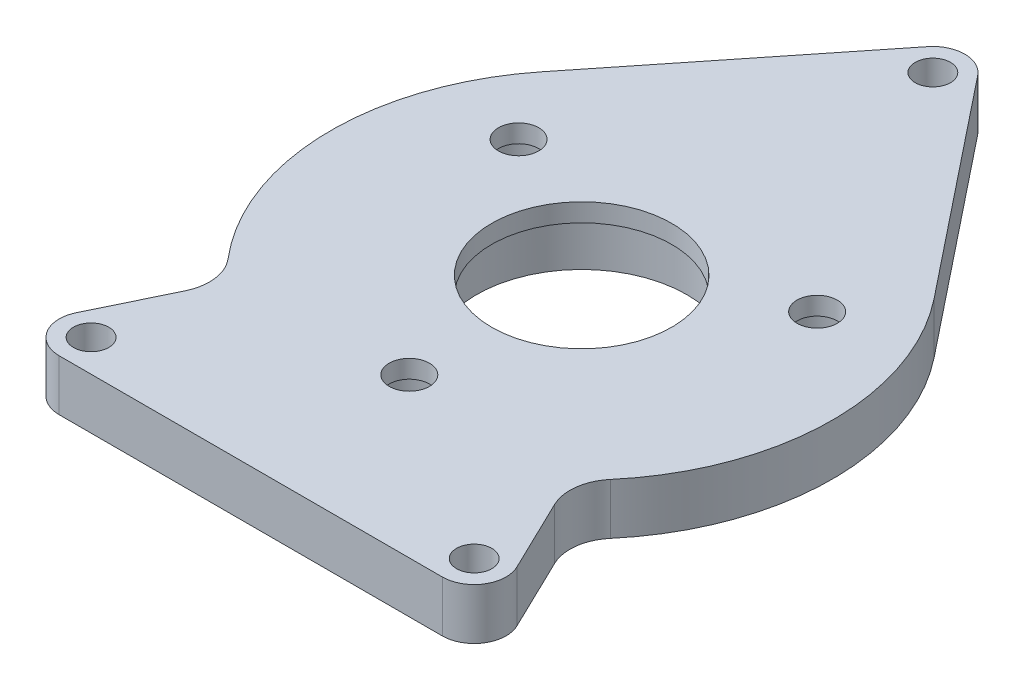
ISO-10303-21;
HEADER;
FILE_DESCRIPTION(('STEP AP214'),'2;1');
FILE_NAME('part.step','',(''),(''),'','','');
FILE_SCHEMA(('AUTOMOTIVE_DESIGN { 1 0 10303 214 1 1 1 1 }'));
ENDSEC;
DATA;
#1=APPLICATION_CONTEXT('core data for automotive mechanical design processes');
#2=APPLICATION_PROTOCOL_DEFINITION('international standard','automotive_design',2000,#1);
#3=PRODUCT_CONTEXT('',#1,'mechanical');
#4=PRODUCT('Part','Part','',(#3));
#5=PRODUCT_RELATED_PRODUCT_CATEGORY('part','',(#4));
#6=PRODUCT_DEFINITION_FORMATION('','',#4);
#7=PRODUCT_DEFINITION_CONTEXT('part definition',#1,'design');
#8=PRODUCT_DEFINITION('design','',#6,#7);
#9=PRODUCT_DEFINITION_SHAPE('','',#8);
#10=(LENGTH_UNIT() NAMED_UNIT(*) SI_UNIT(.MILLI.,.METRE.));
#11=(NAMED_UNIT(*) PLANE_ANGLE_UNIT() SI_UNIT($,.RADIAN.));
#12=(NAMED_UNIT(*) SI_UNIT($,.STERADIAN.) SOLID_ANGLE_UNIT());
#13=UNCERTAINTY_MEASURE_WITH_UNIT(LENGTH_MEASURE(1.E-05),#10,'distance_accuracy_value','');
#14=(GEOMETRIC_REPRESENTATION_CONTEXT(3) GLOBAL_UNCERTAINTY_ASSIGNED_CONTEXT((#13)) GLOBAL_UNIT_ASSIGNED_CONTEXT((#10,
#11,#12)) REPRESENTATION_CONTEXT('',''));
#15=CARTESIAN_POINT('',(0.,0.,0.));
#16=DIRECTION('',(0.,0.,1.));
#17=DIRECTION('',(1.,0.,0.));
#18=AXIS2_PLACEMENT_3D('',#15,#16,#17);
#19=CARTESIAN_POINT('',(26.67,7.112,41.6355512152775));
#20=DIRECTION('',(0.,1.,0.));
#21=DIRECTION('',(0.,0.,1.));
#22=AXIS2_PLACEMENT_3D('',#19,#20,#21);
#23=PLANE('',#22);
#24=CARTESIAN_POINT('',(26.6700000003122,7.112,41.6355512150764));
#25=DIRECTION('',(0.,1.,0.));
#26=DIRECTION('',(0.,0.,1.));
#27=AXIS2_PLACEMENT_3D('',#24,#25,#26);
#28=CIRCLE('',#27,2.45744999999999);
#29=CARTESIAN_POINT('',(26.6700000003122,7.112,44.0930012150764));
#30=VERTEX_POINT('',#29);
#31=EDGE_CURVE('E267',#30,#30,#28,.T.);
#32=ORIENTED_EDGE('',*,*,#31,.F.);
#33=EDGE_LOOP('',(#32));
#34=FACE_BOUND('',#33,.T.);
#35=CARTESIAN_POINT('',(-26.6699999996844,7.112,41.6355512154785));
#36=DIRECTION('',(0.,1.,0.));
#37=DIRECTION('',(0.,0.,1.));
#38=AXIS2_PLACEMENT_3D('',#35,#36,#37);
#39=CIRCLE('',#38,2.45744999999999);
#40=CARTESIAN_POINT('',(-26.6699999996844,7.112,44.0930012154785));
#41=VERTEX_POINT('',#40);
#42=EDGE_CURVE('E264',#41,#41,#39,.T.);
#43=ORIENTED_EDGE('',*,*,#42,.F.);
#44=EDGE_LOOP('',(#43));
#45=FACE_BOUND('',#44,.T.);
#46=CARTESIAN_POINT('',(-3.68547964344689E-10,7.112,-48.895));
#47=DIRECTION('',(0.,1.,0.));
#48=DIRECTION('',(0.,0.,1.));
#49=AXIS2_PLACEMENT_3D('',#46,#47,#48);
#50=CIRCLE('',#49,2.45744999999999);
#51=CARTESIAN_POINT('',(-3.68547964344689E-10,7.112,-46.43755));
#52=VERTEX_POINT('',#51);
#53=EDGE_CURVE('E261',#52,#52,#50,.T.);
#54=ORIENTED_EDGE('',*,*,#53,.F.);
#55=EDGE_LOOP('',(#54));
#56=FACE_BOUND('',#55,.T.);
#57=CARTESIAN_POINT('',(20.7846096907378,7.112,-12.0000000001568));
#58=DIRECTION('',(0.,-1.,0.));
#59=DIRECTION('',(0.,0.,-1.));
#60=AXIS2_PLACEMENT_3D('',#57,#58,#59);
#61=CIRCLE('',#60,2.8067);
#62=CARTESIAN_POINT('',(20.7846096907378,7.112,-14.8067000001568));
#63=VERTEX_POINT('',#62);
#64=EDGE_CURVE('E255',#63,#63,#61,.T.);
#65=ORIENTED_EDGE('',*,*,#64,.T.);
#66=EDGE_LOOP('',(#65));
#67=FACE_BOUND('',#66,.T.);
#68=CARTESIAN_POINT('',(1.82670343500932E-10,7.112,24.));
#69=DIRECTION('',(0.,-1.,0.));
#70=DIRECTION('',(0.,0.,-1.));
#71=AXIS2_PLACEMENT_3D('',#68,#69,#70);
#72=CIRCLE('',#71,2.8067);
#73=CARTESIAN_POINT('',(1.82670343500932E-10,7.112,21.1933));
#74=VERTEX_POINT('',#73);
#75=EDGE_CURVE('E249',#74,#74,#72,.T.);
#76=ORIENTED_EDGE('',*,*,#75,.T.);
#77=EDGE_LOOP('',(#76));
#78=FACE_BOUND('',#77,.T.);
#79=CARTESIAN_POINT('',(0.,7.112,0.));
#80=DIRECTION('',(0.,1.,0.));
#81=DIRECTION('',(0.,0.,1.));
#82=AXIS2_PLACEMENT_3D('',#79,#80,#81);
#83=CIRCLE('',#82,12.538100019);
#84=CARTESIAN_POINT('',(0.,7.112,12.538100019));
#85=VERTEX_POINT('',#84);
#86=EDGE_CURVE('E181',#85,#85,#83,.T.);
#87=ORIENTED_EDGE('',*,*,#86,.F.);
#88=EDGE_LOOP('',(#87));
#89=FACE_BOUND('',#88,.T.);
#90=CARTESIAN_POINT('',(26.67,7.112,41.6355512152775));
#91=DIRECTION('',(0.,1.,0.));
#92=DIRECTION('',(0.,0.,1.));
#93=AXIS2_PLACEMENT_3D('',#90,#91,#92);
#94=CIRCLE('',#93,4.445);
#95=CARTESIAN_POINT('',(26.67,7.112,46.0805512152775));
#96=VERTEX_POINT('',#95);
#97=CARTESIAN_POINT('',(30.6720324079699,7.112,39.7011878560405));
#98=VERTEX_POINT('',#97);
#99=EDGE_CURVE('E207',#96,#98,#94,.T.);
#100=ORIENTED_EDGE('',*,*,#99,.T.);
#101=DIRECTION('',(-0.435177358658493,0.,-0.900344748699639));
#102=VECTOR('',#101,1.);
#103=CARTESIAN_POINT('',(30.6720324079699,7.112,39.7011878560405));
#104=LINE('',#103,#102);
#105=CARTESIAN_POINT('',(25.7363789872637,7.112,29.4897429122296));
#106=VERTEX_POINT('',#105);
#107=EDGE_CURVE('E124',#98,#106,#104,.T.);
#108=ORIENTED_EDGE('',*,*,#107,.T.);
#109=CARTESIAN_POINT('',(31.4535681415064,7.112,26.7263666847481));
#110=DIRECTION('',(0.,-1.,0.));
#111=DIRECTION('',(0.,0.,-1.));
#112=AXIS2_PLACEMENT_3D('',#109,#110,#111);
#113=CIRCLE('',#112,6.35);
#114=CARTESIAN_POINT('',(26.6145576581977,7.112,22.6146179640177));
#115=VERTEX_POINT('',#114);
#116=EDGE_CURVE('E323',#106,#115,#113,.T.);
#117=ORIENTED_EDGE('',*,*,#116,.T.);
#118=CARTESIAN_POINT('',(0.,7.112,0.));
#119=DIRECTION('',(0.,1.,0.));
#120=DIRECTION('',(0.,0.,1.));
#121=AXIS2_PLACEMENT_3D('',#118,#119,#120);
#122=CIRCLE('',#121,34.925);
#123=CARTESIAN_POINT('',(27.308616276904,7.112,-21.7714285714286));
#124=VERTEX_POINT('',#123);
#125=EDGE_CURVE('E325',#115,#124,#122,.T.);
#126=ORIENTED_EDGE('',*,*,#125,.T.);
#127=DIRECTION('',(-0.623376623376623,0.,-0.781921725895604));
#128=VECTOR('',#127,1.);
#129=CARTESIAN_POINT('',(3.47564207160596,7.112,-51.6659090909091));
#130=LINE('',#129,#128);
#131=CARTESIAN_POINT('',(3.47564207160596,7.112,-51.6659090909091));
#132=VERTEX_POINT('',#131);
#133=EDGE_CURVE('E328',#124,#132,#130,.T.);
#134=ORIENTED_EDGE('',*,*,#133,.T.);
#135=CARTESIAN_POINT('',(0.,7.112,-48.895));
#136=DIRECTION('',(0.,1.,0.));
#137=DIRECTION('',(0.,0.,1.));
#138=AXIS2_PLACEMENT_3D('',#135,#136,#137);
#139=CIRCLE('',#138,4.445);
#140=CARTESIAN_POINT('',(-3.47564207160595,7.112,-51.6659090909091));
#141=VERTEX_POINT('',#140);
#142=EDGE_CURVE('E331',#132,#141,#139,.T.);
#143=ORIENTED_EDGE('',*,*,#142,.T.);
#144=DIRECTION('',(-0.623376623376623,0.,0.781921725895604));
#145=VECTOR('',#144,1.);
#146=CARTESIAN_POINT('',(-3.47564207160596,7.112,-51.6659090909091));
#147=LINE('',#146,#145);
#148=CARTESIAN_POINT('',(-27.3086162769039,7.112,-21.7714285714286));
#149=VERTEX_POINT('',#148);
#150=EDGE_CURVE('E334',#141,#149,#147,.T.);
#151=ORIENTED_EDGE('',*,*,#150,.T.);
#152=CARTESIAN_POINT('',(0.,7.112,0.));
#153=DIRECTION('',(0.,1.,0.));
#154=DIRECTION('',(0.,0.,1.));
#155=AXIS2_PLACEMENT_3D('',#152,#153,#154);
#156=CIRCLE('',#155,34.925);
#157=CARTESIAN_POINT('',(-26.6145576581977,7.112,22.6146179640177));
#158=VERTEX_POINT('',#157);
#159=EDGE_CURVE('E337',#149,#158,#156,.T.);
#160=ORIENTED_EDGE('',*,*,#159,.T.);
#161=CARTESIAN_POINT('',(-31.4535681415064,7.112,26.7263666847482));
#162=DIRECTION('',(0.,-1.,0.));
#163=DIRECTION('',(0.,0.,1.));
#164=AXIS2_PLACEMENT_3D('',#161,#162,#163);
#165=CIRCLE('',#164,6.35);
#166=CARTESIAN_POINT('',(-25.7363789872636,7.112,29.4897429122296));
#167=VERTEX_POINT('',#166);
#168=EDGE_CURVE('E159',#158,#167,#165,.T.);
#169=ORIENTED_EDGE('',*,*,#168,.T.);
#170=DIRECTION('',(-0.435177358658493,0.,0.90034474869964));
#171=VECTOR('',#170,1.);
#172=CARTESIAN_POINT('',(-25.7363789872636,7.112,29.4897429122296));
#173=LINE('',#172,#171);
#174=CARTESIAN_POINT('',(-30.6720324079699,7.112,39.7011878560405));
#175=VERTEX_POINT('',#174);
#176=EDGE_CURVE('E153',#167,#175,#173,.T.);
#177=ORIENTED_EDGE('',*,*,#176,.T.);
#178=CARTESIAN_POINT('',(-26.67,7.112,41.6355512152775));
#179=DIRECTION('',(0.,1.,0.));
#180=DIRECTION('',(0.,0.,1.));
#181=AXIS2_PLACEMENT_3D('',#178,#179,#180);
#182=CIRCLE('',#181,4.445);
#183=CARTESIAN_POINT('',(-26.67,7.112,46.0805512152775));
#184=VERTEX_POINT('',#183);
#185=EDGE_CURVE('E157',#175,#184,#182,.T.);
#186=ORIENTED_EDGE('',*,*,#185,.T.);
#187=DIRECTION('',(1.,0.,0.));
#188=VECTOR('',#187,1.);
#189=CARTESIAN_POINT('',(-26.67,7.112,46.0805512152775));
#190=LINE('',#189,#188);
#191=EDGE_CURVE('E63',#184,#96,#190,.T.);
#192=ORIENTED_EDGE('',*,*,#191,.T.);
#193=EDGE_LOOP('',(#100,#108,#117,#126,#134,#143,#151,#160,#169,#177,#186,#192));
#194=FACE_BOUND('',#193,.T.);
#195=CARTESIAN_POINT('',(-20.7846096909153,7.112,-11.9999999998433));
#196=DIRECTION('',(0.,-1.,0.));
#197=DIRECTION('',(0.,0.,-1.));
#198=AXIS2_PLACEMENT_3D('',#195,#196,#197);
#199=CIRCLE('',#198,2.8067);
#200=CARTESIAN_POINT('',(-20.7846096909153,7.112,-14.8066999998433));
#201=VERTEX_POINT('',#200);
#202=EDGE_CURVE('E243',#201,#201,#199,.T.);
#203=ORIENTED_EDGE('',*,*,#202,.T.);
#204=EDGE_LOOP('',(#203));
#205=FACE_BOUND('',#204,.T.);
#206=ADVANCED_FACE('F43',(#34,#45,#56,#67,#78,#89,#194,#205),#23,.T.);
#207=CARTESIAN_POINT('',(26.67,0.,41.6355512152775));
#208=DIRECTION('',(0.,1.,0.));
#209=DIRECTION('',(0.,0.,1.));
#210=AXIS2_PLACEMENT_3D('',#207,#208,#209);
#211=PLANE('',#210);
#212=CARTESIAN_POINT('',(26.6700000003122,0.,41.6355512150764));
#213=DIRECTION('',(0.,1.,0.));
#214=DIRECTION('',(0.,0.,1.));
#215=AXIS2_PLACEMENT_3D('',#212,#213,#214);
#216=CIRCLE('',#215,2.45744999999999);
#217=CARTESIAN_POINT('',(26.6700000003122,0.,44.0930012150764));
#218=VERTEX_POINT('',#217);
#219=EDGE_CURVE('E265',#218,#218,#216,.T.);
#220=ORIENTED_EDGE('',*,*,#219,.T.);
#221=EDGE_LOOP('',(#220));
#222=FACE_BOUND('',#221,.T.);
#223=CARTESIAN_POINT('',(-26.6699999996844,0.,41.6355512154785));
#224=DIRECTION('',(0.,1.,0.));
#225=DIRECTION('',(0.,0.,1.));
#226=AXIS2_PLACEMENT_3D('',#223,#224,#225);
#227=CIRCLE('',#226,2.45744999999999);
#228=CARTESIAN_POINT('',(-26.6699999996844,0.,44.0930012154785));
#229=VERTEX_POINT('',#228);
#230=EDGE_CURVE('E262',#229,#229,#227,.T.);
#231=ORIENTED_EDGE('',*,*,#230,.T.);
#232=EDGE_LOOP('',(#231));
#233=FACE_BOUND('',#232,.T.);
#234=CARTESIAN_POINT('',(-3.68547964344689E-10,0.,-48.895));
#235=DIRECTION('',(0.,1.,0.));
#236=DIRECTION('',(0.,0.,1.));
#237=AXIS2_PLACEMENT_3D('',#234,#235,#236);
#238=CIRCLE('',#237,2.45744999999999);
#239=CARTESIAN_POINT('',(-3.68547964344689E-10,0.,-46.43755));
#240=VERTEX_POINT('',#239);
#241=EDGE_CURVE('E256',#240,#240,#238,.T.);
#242=ORIENTED_EDGE('',*,*,#241,.T.);
#243=EDGE_LOOP('',(#242));
#244=FACE_BOUND('',#243,.T.);
#245=CARTESIAN_POINT('',(20.7846096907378,0.,-12.0000000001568));
#246=DIRECTION('',(0.,1.,0.));
#247=DIRECTION('',(0.,0.,1.));
#248=AXIS2_PLACEMENT_3D('',#245,#246,#247);
#249=CIRCLE('',#248,4.96062);
#250=CARTESIAN_POINT('',(20.7846096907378,0.,-7.03938000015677));
#251=VERTEX_POINT('',#250);
#252=EDGE_CURVE('E250',#251,#251,#249,.T.);
#253=ORIENTED_EDGE('',*,*,#252,.T.);
#254=EDGE_LOOP('',(#253));
#255=FACE_BOUND('',#254,.T.);
#256=CARTESIAN_POINT('',(1.82670343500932E-10,0.,24.));
#257=DIRECTION('',(0.,1.,0.));
#258=DIRECTION('',(0.,0.,1.));
#259=AXIS2_PLACEMENT_3D('',#256,#257,#258);
#260=CIRCLE('',#259,4.96062);
#261=CARTESIAN_POINT('',(1.82670343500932E-10,0.,28.96062));
#262=VERTEX_POINT('',#261);
#263=EDGE_CURVE('E244',#262,#262,#260,.T.);
#264=ORIENTED_EDGE('',*,*,#263,.T.);
#265=EDGE_LOOP('',(#264));
#266=FACE_BOUND('',#265,.T.);
#267=CARTESIAN_POINT('',(-20.7846096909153,0.,-11.9999999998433));
#268=DIRECTION('',(0.,1.,0.));
#269=DIRECTION('',(0.,0.,1.));
#270=AXIS2_PLACEMENT_3D('',#267,#268,#269);
#271=CIRCLE('',#270,4.96062);
#272=CARTESIAN_POINT('',(-20.7846096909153,0.,-7.03937999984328));
#273=VERTEX_POINT('',#272);
#274=EDGE_CURVE('E238',#273,#273,#271,.T.);
#275=ORIENTED_EDGE('',*,*,#274,.T.);
#276=EDGE_LOOP('',(#275));
#277=FACE_BOUND('',#276,.T.);
#278=CARTESIAN_POINT('',(26.67,0.,41.6355512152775));
#279=DIRECTION('',(0.,1.,0.));
#280=DIRECTION('',(0.,0.,1.));
#281=AXIS2_PLACEMENT_3D('',#278,#279,#280);
#282=CIRCLE('',#281,4.445);
#283=CARTESIAN_POINT('',(26.67,0.,46.0805512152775));
#284=VERTEX_POINT('',#283);
#285=CARTESIAN_POINT('',(30.6720324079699,0.,39.7011878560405));
#286=VERTEX_POINT('',#285);
#287=EDGE_CURVE('E177',#284,#286,#282,.T.);
#288=ORIENTED_EDGE('',*,*,#287,.F.);
#289=DIRECTION('',(1.,0.,0.));
#290=VECTOR('',#289,1.);
#291=CARTESIAN_POINT('',(-26.67,0.,46.0805512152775));
#292=LINE('',#291,#290);
#293=CARTESIAN_POINT('',(-26.67,0.,46.0805512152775));
#294=VERTEX_POINT('',#293);
#295=EDGE_CURVE('E115',#294,#284,#292,.T.);
#296=ORIENTED_EDGE('',*,*,#295,.F.);
#297=CARTESIAN_POINT('',(-26.67,0.,41.6355512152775));
#298=DIRECTION('',(0.,1.,0.));
#299=DIRECTION('',(0.,0.,1.));
#300=AXIS2_PLACEMENT_3D('',#297,#298,#299);
#301=CIRCLE('',#300,4.445);
#302=CARTESIAN_POINT('',(-30.6720324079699,0.,39.7011878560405));
#303=VERTEX_POINT('',#302);
#304=EDGE_CURVE('E109',#303,#294,#301,.T.);
#305=ORIENTED_EDGE('',*,*,#304,.F.);
#306=DIRECTION('',(-0.435177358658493,0.,0.90034474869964));
#307=VECTOR('',#306,1.);
#308=CARTESIAN_POINT('',(-25.7363789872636,0.,29.4897429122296));
#309=LINE('',#308,#307);
#310=CARTESIAN_POINT('',(-25.7363789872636,0.,29.4897429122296));
#311=VERTEX_POINT('',#310);
#312=EDGE_CURVE('E167',#311,#303,#309,.T.);
#313=ORIENTED_EDGE('',*,*,#312,.F.);
#314=CARTESIAN_POINT('',(-31.4535681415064,0.,26.7263666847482));
#315=DIRECTION('',(0.,-1.,0.));
#316=DIRECTION('',(0.,0.,1.));
#317=AXIS2_PLACEMENT_3D('',#314,#315,#316);
#318=CIRCLE('',#317,6.35);
#319=CARTESIAN_POINT('',(-26.6145576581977,0.,22.6146179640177));
#320=VERTEX_POINT('',#319);
#321=EDGE_CURVE('E200',#320,#311,#318,.T.);
#322=ORIENTED_EDGE('',*,*,#321,.F.);
#323=CARTESIAN_POINT('',(0.,0.,0.));
#324=DIRECTION('',(0.,1.,0.));
#325=DIRECTION('',(0.,0.,1.));
#326=AXIS2_PLACEMENT_3D('',#323,#324,#325);
#327=CIRCLE('',#326,34.925);
#328=CARTESIAN_POINT('',(-27.3086162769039,0.,-21.7714285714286));
#329=VERTEX_POINT('',#328);
#330=EDGE_CURVE('E197',#329,#320,#327,.T.);
#331=ORIENTED_EDGE('',*,*,#330,.F.);
#332=DIRECTION('',(-0.623376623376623,0.,0.781921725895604));
#333=VECTOR('',#332,1.);
#334=CARTESIAN_POINT('',(-3.47564207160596,0.,-51.6659090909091));
#335=LINE('',#334,#333);
#336=CARTESIAN_POINT('',(-3.47564207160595,0.,-51.6659090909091));
#337=VERTEX_POINT('',#336);
#338=EDGE_CURVE('E194',#337,#329,#335,.T.);
#339=ORIENTED_EDGE('',*,*,#338,.F.);
#340=CARTESIAN_POINT('',(0.,0.,-48.895));
#341=DIRECTION('',(0.,1.,0.));
#342=DIRECTION('',(0.,0.,1.));
#343=AXIS2_PLACEMENT_3D('',#340,#341,#342);
#344=CIRCLE('',#343,4.445);
#345=CARTESIAN_POINT('',(3.47564207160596,0.,-51.6659090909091));
#346=VERTEX_POINT('',#345);
#347=EDGE_CURVE('E191',#346,#337,#344,.T.);
#348=ORIENTED_EDGE('',*,*,#347,.F.);
#349=DIRECTION('',(-0.623376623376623,0.,-0.781921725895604));
#350=VECTOR('',#349,1.);
#351=CARTESIAN_POINT('',(3.47564207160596,0.,-51.6659090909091));
#352=LINE('',#351,#350);
#353=CARTESIAN_POINT('',(27.308616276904,0.,-21.7714285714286));
#354=VERTEX_POINT('',#353);
#355=EDGE_CURVE('E188',#354,#346,#352,.T.);
#356=ORIENTED_EDGE('',*,*,#355,.F.);
#357=CARTESIAN_POINT('',(0.,0.,0.));
#358=DIRECTION('',(0.,1.,0.));
#359=DIRECTION('',(0.,0.,1.));
#360=AXIS2_PLACEMENT_3D('',#357,#358,#359);
#361=CIRCLE('',#360,34.925);
#362=CARTESIAN_POINT('',(26.6145576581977,0.,22.6146179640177));
#363=VERTEX_POINT('',#362);
#364=EDGE_CURVE('E185',#363,#354,#361,.T.);
#365=ORIENTED_EDGE('',*,*,#364,.F.);
#366=CARTESIAN_POINT('',(31.4535681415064,0.,26.7263666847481));
#367=DIRECTION('',(0.,-1.,0.));
#368=DIRECTION('',(0.,0.,-1.));
#369=AXIS2_PLACEMENT_3D('',#366,#367,#368);
#370=CIRCLE('',#369,6.35);
#371=CARTESIAN_POINT('',(25.7363789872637,0.,29.4897429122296));
#372=VERTEX_POINT('',#371);
#373=EDGE_CURVE('E183',#372,#363,#370,.T.);
#374=ORIENTED_EDGE('',*,*,#373,.F.);
#375=DIRECTION('',(-0.435177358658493,0.,-0.900344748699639));
#376=VECTOR('',#375,1.);
#377=CARTESIAN_POINT('',(30.6720324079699,0.,39.7011878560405));
#378=LINE('',#377,#376);
#379=EDGE_CURVE('E180',#286,#372,#378,.T.);
#380=ORIENTED_EDGE('',*,*,#379,.F.);
#381=EDGE_LOOP('',(#288,#296,#305,#313,#322,#331,#339,#348,#356,#365,#374,#380));
#382=FACE_BOUND('',#381,.T.);
#383=CARTESIAN_POINT('',(0.,0.,0.));
#384=DIRECTION('',(0.,1.,0.));
#385=DIRECTION('',(0.,0.,1.));
#386=AXIS2_PLACEMENT_3D('',#383,#384,#385);
#387=CIRCLE('',#386,19.0373);
#388=CARTESIAN_POINT('',(0.,0.,19.0373));
#389=VERTEX_POINT('',#388);
#390=EDGE_CURVE('E12',#389,#389,#387,.F.);
#391=ORIENTED_EDGE('',*,*,#390,.F.);
#392=EDGE_LOOP('',(#391));
#393=FACE_BOUND('',#392,.T.);
#394=ADVANCED_FACE('F351',(#222,#233,#244,#255,#266,#277,#382,#393),#211,.F.);
#395=CARTESIAN_POINT('',(26.67,7.112,41.6355512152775));
#396=DIRECTION('',(0.,-1.,0.));
#397=DIRECTION('',(0.,0.,-1.));
#398=AXIS2_PLACEMENT_3D('',#395,#396,#397);
#399=CYLINDRICAL_SURFACE('',#398,4.445);
#400=ORIENTED_EDGE('',*,*,#287,.T.);
#401=DIRECTION('',(0.,-1.,0.));
#402=VECTOR('',#401,1.);
#403=CARTESIAN_POINT('',(30.6720324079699,7.112,39.7011878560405));
#404=LINE('',#403,#402);
#405=EDGE_CURVE('E54',#98,#286,#404,.T.);
#406=ORIENTED_EDGE('',*,*,#405,.F.);
#407=ORIENTED_EDGE('',*,*,#99,.F.);
#408=DIRECTION('',(0.,-1.,0.));
#409=VECTOR('',#408,1.);
#410=CARTESIAN_POINT('',(26.67,7.112,46.0805512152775));
#411=LINE('',#410,#409);
#412=EDGE_CURVE('E173',#96,#284,#411,.T.);
#413=ORIENTED_EDGE('',*,*,#412,.T.);
#414=EDGE_LOOP('',(#400,#406,#407,#413));
#415=FACE_BOUND('',#414,.T.);
#416=ADVANCED_FACE('F45',(#415),#399,.T.);
#417=CARTESIAN_POINT('',(30.6720324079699,7.112,39.7011878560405));
#418=DIRECTION('',(-0.900344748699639,0.,0.435177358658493));
#419=DIRECTION('',(0.435177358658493,0.,0.90034474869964));
#420=AXIS2_PLACEMENT_3D('',#417,#418,#419);
#421=PLANE('',#420);
#422=ORIENTED_EDGE('',*,*,#379,.T.);
#423=DIRECTION('',(0.,-1.,0.));
#424=VECTOR('',#423,1.);
#425=CARTESIAN_POINT('',(25.7363789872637,7.112,29.4897429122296));
#426=LINE('',#425,#424);
#427=EDGE_CURVE('E234',#106,#372,#426,.T.);
#428=ORIENTED_EDGE('',*,*,#427,.F.);
#429=ORIENTED_EDGE('',*,*,#107,.F.);
#430=ORIENTED_EDGE('',*,*,#405,.T.);
#431=EDGE_LOOP('',(#422,#428,#429,#430));
#432=FACE_BOUND('',#431,.T.);
#433=ADVANCED_FACE('F580',(#432),#421,.F.);
#434=CARTESIAN_POINT('',(31.4535681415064,7.112,26.7263666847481));
#435=DIRECTION('',(0.,-1.,0.));
#436=DIRECTION('',(0.,0.,-1.));
#437=AXIS2_PLACEMENT_3D('',#434,#435,#436);
#438=CYLINDRICAL_SURFACE('',#437,6.35);
#439=ORIENTED_EDGE('',*,*,#373,.T.);
#440=DIRECTION('',(0.,-1.,0.));
#441=VECTOR('',#440,1.);
#442=CARTESIAN_POINT('',(26.6145576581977,7.112,22.6146179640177));
#443=LINE('',#442,#441);
#444=EDGE_CURVE('E231',#115,#363,#443,.T.);
#445=ORIENTED_EDGE('',*,*,#444,.F.);
#446=ORIENTED_EDGE('',*,*,#116,.F.);
#447=ORIENTED_EDGE('',*,*,#427,.T.);
#448=EDGE_LOOP('',(#439,#445,#446,#447));
#449=FACE_BOUND('',#448,.T.);
#450=ADVANCED_FACE('F586',(#449),#438,.F.);
#451=CARTESIAN_POINT('',(0.,7.112,0.));
#452=DIRECTION('',(0.,-1.,0.));
#453=DIRECTION('',(0.,0.,-1.));
#454=AXIS2_PLACEMENT_3D('',#451,#452,#453);
#455=CYLINDRICAL_SURFACE('',#454,34.925);
#456=ORIENTED_EDGE('',*,*,#364,.T.);
#457=DIRECTION('',(0.,-1.,0.));
#458=VECTOR('',#457,1.);
#459=CARTESIAN_POINT('',(27.308616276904,7.112,-21.7714285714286));
#460=LINE('',#459,#458);
#461=EDGE_CURVE('E227',#124,#354,#460,.T.);
#462=ORIENTED_EDGE('',*,*,#461,.F.);
#463=ORIENTED_EDGE('',*,*,#125,.F.);
#464=ORIENTED_EDGE('',*,*,#444,.T.);
#465=EDGE_LOOP('',(#456,#462,#463,#464));
#466=FACE_BOUND('',#465,.T.);
#467=ADVANCED_FACE('F592',(#466),#455,.T.);
#468=CARTESIAN_POINT('',(3.47564207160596,7.112,-51.6659090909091));
#469=DIRECTION('',(-0.781921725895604,0.,0.623376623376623));
#470=DIRECTION('',(0.623376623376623,0.,0.781921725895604));
#471=AXIS2_PLACEMENT_3D('',#468,#469,#470);
#472=PLANE('',#471);
#473=ORIENTED_EDGE('',*,*,#355,.T.);
#474=DIRECTION('',(0.,-1.,0.));
#475=VECTOR('',#474,1.);
#476=CARTESIAN_POINT('',(3.47564207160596,7.112,-51.6659090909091));
#477=LINE('',#476,#475);
#478=EDGE_CURVE('E223',#132,#346,#477,.T.);
#479=ORIENTED_EDGE('',*,*,#478,.F.);
#480=ORIENTED_EDGE('',*,*,#133,.F.);
#481=ORIENTED_EDGE('',*,*,#461,.T.);
#482=EDGE_LOOP('',(#473,#479,#480,#481));
#483=FACE_BOUND('',#482,.T.);
#484=ADVANCED_FACE('F600',(#483),#472,.F.);
#485=CARTESIAN_POINT('',(0.,7.112,-48.895));
#486=DIRECTION('',(0.,-1.,0.));
#487=DIRECTION('',(0.,0.,-1.));
#488=AXIS2_PLACEMENT_3D('',#485,#486,#487);
#489=CYLINDRICAL_SURFACE('',#488,4.445);
#490=ORIENTED_EDGE('',*,*,#347,.T.);
#491=DIRECTION('',(0.,-1.,0.));
#492=VECTOR('',#491,1.);
#493=CARTESIAN_POINT('',(-3.47564207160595,7.112,-51.6659090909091));
#494=LINE('',#493,#492);
#495=EDGE_CURVE('E219',#141,#337,#494,.T.);
#496=ORIENTED_EDGE('',*,*,#495,.F.);
#497=ORIENTED_EDGE('',*,*,#142,.F.);
#498=ORIENTED_EDGE('',*,*,#478,.T.);
#499=EDGE_LOOP('',(#490,#496,#497,#498));
#500=FACE_BOUND('',#499,.T.);
#501=ADVANCED_FACE('F605',(#500),#489,.T.);
#502=CARTESIAN_POINT('',(-3.47564207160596,7.112,-51.6659090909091));
#503=DIRECTION('',(0.781921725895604,0.,0.623376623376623));
#504=DIRECTION('',(0.623376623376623,0.,-0.781921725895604));
#505=AXIS2_PLACEMENT_3D('',#502,#503,#504);
#506=PLANE('',#505);
#507=ORIENTED_EDGE('',*,*,#338,.T.);
#508=DIRECTION('',(0.,-1.,0.));
#509=VECTOR('',#508,1.);
#510=CARTESIAN_POINT('',(-27.3086162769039,7.112,-21.7714285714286));
#511=LINE('',#510,#509);
#512=EDGE_CURVE('E215',#149,#329,#511,.T.);
#513=ORIENTED_EDGE('',*,*,#512,.F.);
#514=ORIENTED_EDGE('',*,*,#150,.F.);
#515=ORIENTED_EDGE('',*,*,#495,.T.);
#516=EDGE_LOOP('',(#507,#513,#514,#515));
#517=FACE_BOUND('',#516,.T.);
#518=ADVANCED_FACE('F612',(#517),#506,.F.);
#519=CARTESIAN_POINT('',(0.,7.112,0.));
#520=DIRECTION('',(0.,-1.,0.));
#521=DIRECTION('',(0.,0.,-1.));
#522=AXIS2_PLACEMENT_3D('',#519,#520,#521);
#523=CYLINDRICAL_SURFACE('',#522,34.925);
#524=ORIENTED_EDGE('',*,*,#330,.T.);
#525=DIRECTION('',(0.,-1.,0.));
#526=VECTOR('',#525,1.);
#527=CARTESIAN_POINT('',(-26.6145576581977,7.112,22.6146179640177));
#528=LINE('',#527,#526);
#529=EDGE_CURVE('E212',#158,#320,#528,.T.);
#530=ORIENTED_EDGE('',*,*,#529,.F.);
#531=ORIENTED_EDGE('',*,*,#159,.F.);
#532=ORIENTED_EDGE('',*,*,#512,.T.);
#533=EDGE_LOOP('',(#524,#530,#531,#532));
#534=FACE_BOUND('',#533,.T.);
#535=ADVANCED_FACE('F344',(#534),#523,.T.);
#536=CARTESIAN_POINT('',(-31.4535681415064,7.112,26.7263666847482));
#537=DIRECTION('',(0.,-1.,0.));
#538=DIRECTION('',(0.,0.,-1.));
#539=AXIS2_PLACEMENT_3D('',#536,#537,#538);
#540=CYLINDRICAL_SURFACE('',#539,6.35);
#541=ORIENTED_EDGE('',*,*,#321,.T.);
#542=DIRECTION('',(0.,-1.,0.));
#543=VECTOR('',#542,1.);
#544=CARTESIAN_POINT('',(-25.7363789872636,7.112,29.4897429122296));
#545=LINE('',#544,#543);
#546=EDGE_CURVE('E168',#167,#311,#545,.T.);
#547=ORIENTED_EDGE('',*,*,#546,.F.);
#548=ORIENTED_EDGE('',*,*,#168,.F.);
#549=ORIENTED_EDGE('',*,*,#529,.T.);
#550=EDGE_LOOP('',(#541,#547,#548,#549));
#551=FACE_BOUND('',#550,.T.);
#552=ADVANCED_FACE('F348',(#551),#540,.F.);
#553=CARTESIAN_POINT('',(-25.7363789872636,7.112,29.4897429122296));
#554=DIRECTION('',(0.900344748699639,0.,0.435177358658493));
#555=DIRECTION('',(0.435177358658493,0.,-0.90034474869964));
#556=AXIS2_PLACEMENT_3D('',#553,#554,#555);
#557=PLANE('',#556);
#558=ORIENTED_EDGE('',*,*,#312,.T.);
#559=DIRECTION('',(0.,-1.,0.));
#560=VECTOR('',#559,1.);
#561=CARTESIAN_POINT('',(-30.6720324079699,7.112,39.7011878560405));
#562=LINE('',#561,#560);
#563=EDGE_CURVE('E164',#175,#303,#562,.T.);
#564=ORIENTED_EDGE('',*,*,#563,.F.);
#565=ORIENTED_EDGE('',*,*,#176,.F.);
#566=ORIENTED_EDGE('',*,*,#546,.T.);
#567=EDGE_LOOP('',(#558,#564,#565,#566));
#568=FACE_BOUND('',#567,.T.);
#569=ADVANCED_FACE('F165',(#568),#557,.F.);
#570=CARTESIAN_POINT('',(-26.67,7.112,41.6355512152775));
#571=DIRECTION('',(0.,-1.,0.));
#572=DIRECTION('',(0.,0.,-1.));
#573=AXIS2_PLACEMENT_3D('',#570,#571,#572);
#574=CYLINDRICAL_SURFACE('',#573,4.445);
#575=ORIENTED_EDGE('',*,*,#304,.T.);
#576=DIRECTION('',(0.,-1.,0.));
#577=VECTOR('',#576,1.);
#578=CARTESIAN_POINT('',(-26.67,7.112,46.0805512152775));
#579=LINE('',#578,#577);
#580=EDGE_CURVE('E169',#184,#294,#579,.T.);
#581=ORIENTED_EDGE('',*,*,#580,.F.);
#582=ORIENTED_EDGE('',*,*,#185,.F.);
#583=ORIENTED_EDGE('',*,*,#563,.T.);
#584=EDGE_LOOP('',(#575,#581,#582,#583));
#585=FACE_BOUND('',#584,.T.);
#586=ADVANCED_FACE('F171',(#585),#574,.T.);
#587=CARTESIAN_POINT('',(-26.67,7.112,46.0805512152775));
#588=DIRECTION('',(0.,0.,-1.));
#589=DIRECTION('',(-1.,0.,0.));
#590=AXIS2_PLACEMENT_3D('',#587,#588,#589);
#591=PLANE('',#590);
#592=ORIENTED_EDGE('',*,*,#295,.T.);
#593=ORIENTED_EDGE('',*,*,#412,.F.);
#594=ORIENTED_EDGE('',*,*,#191,.F.);
#595=ORIENTED_EDGE('',*,*,#580,.T.);
#596=EDGE_LOOP('',(#592,#593,#594,#595));
#597=FACE_BOUND('',#596,.T.);
#598=ADVANCED_FACE('F357',(#597),#591,.F.);
#599=CARTESIAN_POINT('',(0.,7.112,0.));
#600=DIRECTION('',(0.,-1.,0.));
#601=DIRECTION('',(0.,0.,-1.));
#602=AXIS2_PLACEMENT_3D('',#599,#600,#601);
#603=CYLINDRICAL_SURFACE('',#602,12.538100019);
#604=CARTESIAN_POINT('',(0.,4.572,0.));
#605=DIRECTION('',(0.,1.,0.));
#606=DIRECTION('',(0.,0.,1.));
#607=AXIS2_PLACEMENT_3D('',#604,#605,#606);
#608=CIRCLE('',#607,12.538100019);
#609=CARTESIAN_POINT('',(0.,4.572,12.538100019));
#610=VERTEX_POINT('',#609);
#611=EDGE_CURVE('E47',#610,#610,#608,.T.);
#612=ORIENTED_EDGE('',*,*,#611,.F.);
#613=EDGE_LOOP('',(#612));
#614=FACE_BOUND('',#613,.T.);
#615=ORIENTED_EDGE('',*,*,#86,.T.);
#616=EDGE_LOOP('',(#615));
#617=FACE_BOUND('',#616,.T.);
#618=ADVANCED_FACE('F359',(#614,#617),#603,.F.);
#619=CARTESIAN_POINT('',(0.,-2.54,0.));
#620=DIRECTION('',(0.,-1.,0.));
#621=DIRECTION('',(0.,0.,-1.));
#622=AXIS2_PLACEMENT_3D('',#619,#620,#621);
#623=PLANE('',#622);
#624=CARTESIAN_POINT('',(0.,-2.54,0.));
#625=DIRECTION('',(0.,-1.,0.));
#626=DIRECTION('',(0.,0.,-1.));
#627=AXIS2_PLACEMENT_3D('',#624,#625,#626);
#628=CIRCLE('',#627,14.6431);
#629=CARTESIAN_POINT('',(0.,-2.54,-14.6431));
#630=VERTEX_POINT('',#629);
#631=EDGE_CURVE('E444',#630,#630,#628,.T.);
#632=ORIENTED_EDGE('',*,*,#631,.F.);
#633=EDGE_LOOP('',(#632));
#634=FACE_BOUND('',#633,.T.);
#635=CARTESIAN_POINT('',(0.,-2.54,0.));
#636=DIRECTION('',(0.,-1.,0.));
#637=DIRECTION('',(0.,0.,-1.));
#638=AXIS2_PLACEMENT_3D('',#635,#636,#637);
#639=CIRCLE('',#638,19.0373);
#640=CARTESIAN_POINT('',(0.,-2.54,-19.0373));
#641=VERTEX_POINT('',#640);
#642=EDGE_CURVE('E242',#641,#641,#639,.T.);
#643=ORIENTED_EDGE('',*,*,#642,.T.);
#644=EDGE_LOOP('',(#643));
#645=FACE_BOUND('',#644,.T.);
#646=ADVANCED_FACE('F365',(#634,#645),#623,.T.);
#647=CARTESIAN_POINT('',(0.,-2.54,0.));
#648=DIRECTION('',(0.,1.,0.));
#649=DIRECTION('',(0.,0.,1.));
#650=AXIS2_PLACEMENT_3D('',#647,#648,#649);
#651=CYLINDRICAL_SURFACE('',#650,19.0373);
#652=ORIENTED_EDGE('',*,*,#642,.F.);
#653=EDGE_LOOP('',(#652));
#654=FACE_BOUND('',#653,.T.);
#655=ORIENTED_EDGE('',*,*,#390,.T.);
#656=EDGE_LOOP('',(#655));
#657=FACE_BOUND('',#656,.T.);
#658=ADVANCED_FACE('F378',(#654,#657),#651,.T.);
#659=CARTESIAN_POINT('',(-20.7846096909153,-2.54,-11.9999999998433));
#660=DIRECTION('',(0.,-1.,0.));
#661=DIRECTION('',(0.,0.,-1.));
#662=AXIS2_PLACEMENT_3D('',#659,#660,#661);
#663=CYLINDRICAL_SURFACE('',#662,4.96062);
#664=CARTESIAN_POINT('',(-20.7846096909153,4.5974,-11.9999999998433));
#665=DIRECTION('',(0.,-1.,0.));
#666=DIRECTION('',(0.,0.,-1.));
#667=AXIS2_PLACEMENT_3D('',#664,#665,#666);
#668=CIRCLE('',#667,4.96062);
#669=CARTESIAN_POINT('',(-20.7846096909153,4.5974,-16.9606199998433));
#670=VERTEX_POINT('',#669);
#671=EDGE_CURVE('E248',#670,#670,#668,.T.);
#672=ORIENTED_EDGE('',*,*,#671,.F.);
#673=EDGE_LOOP('',(#672));
#674=FACE_BOUND('',#673,.T.);
#675=ORIENTED_EDGE('',*,*,#274,.F.);
#676=EDGE_LOOP('',(#675));
#677=FACE_BOUND('',#676,.T.);
#678=ADVANCED_FACE('F381',(#674,#677),#663,.F.);
#679=CARTESIAN_POINT('',(-20.7846096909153,-2.54,-11.9999999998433));
#680=DIRECTION('',(0.,-1.,0.));
#681=DIRECTION('',(0.,0.,-1.));
#682=AXIS2_PLACEMENT_3D('',#679,#680,#681);
#683=CYLINDRICAL_SURFACE('',#682,2.8067);
#684=ORIENTED_EDGE('',*,*,#202,.F.);
#685=EDGE_LOOP('',(#684));
#686=FACE_BOUND('',#685,.T.);
#687=CARTESIAN_POINT('',(-20.7846096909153,4.5974,-11.9999999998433));
#688=DIRECTION('',(0.,-1.,0.));
#689=DIRECTION('',(0.,0.,-1.));
#690=AXIS2_PLACEMENT_3D('',#687,#688,#689);
#691=CIRCLE('',#690,2.8067);
#692=CARTESIAN_POINT('',(-20.7846096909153,4.5974,-14.8066999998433));
#693=VERTEX_POINT('',#692);
#694=EDGE_CURVE('E308',#693,#693,#691,.T.);
#695=ORIENTED_EDGE('',*,*,#694,.T.);
#696=EDGE_LOOP('',(#695));
#697=FACE_BOUND('',#696,.T.);
#698=ADVANCED_FACE('F386',(#686,#697),#683,.F.);
#699=CARTESIAN_POINT('',(-17.9779096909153,4.5974,-11.9999999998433));
#700=DIRECTION('',(0.,1.,0.));
#701=DIRECTION('',(0.,0.,1.));
#702=AXIS2_PLACEMENT_3D('',#699,#700,#701);
#703=PLANE('',#702);
#704=ORIENTED_EDGE('',*,*,#694,.F.);
#705=EDGE_LOOP('',(#704));
#706=FACE_BOUND('',#705,.T.);
#707=ORIENTED_EDGE('',*,*,#671,.T.);
#708=EDGE_LOOP('',(#707));
#709=FACE_BOUND('',#708,.T.);
#710=ADVANCED_FACE('F389',(#706,#709),#703,.F.);
#711=CARTESIAN_POINT('',(1.82670343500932E-10,-2.54,24.));
#712=DIRECTION('',(0.,-1.,0.));
#713=DIRECTION('',(0.,0.,-1.));
#714=AXIS2_PLACEMENT_3D('',#711,#712,#713);
#715=CYLINDRICAL_SURFACE('',#714,4.96062);
#716=CARTESIAN_POINT('',(1.82670343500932E-10,4.5974,24.));
#717=DIRECTION('',(0.,-1.,0.));
#718=DIRECTION('',(0.,0.,-1.));
#719=AXIS2_PLACEMENT_3D('',#716,#717,#718);
#720=CIRCLE('',#719,4.96062);
#721=CARTESIAN_POINT('',(1.82670343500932E-10,4.5974,19.03938));
#722=VERTEX_POINT('',#721);
#723=EDGE_CURVE('E254',#722,#722,#720,.T.);
#724=ORIENTED_EDGE('',*,*,#723,.F.);
#725=EDGE_LOOP('',(#724));
#726=FACE_BOUND('',#725,.T.);
#727=ORIENTED_EDGE('',*,*,#263,.F.);
#728=EDGE_LOOP('',(#727));
#729=FACE_BOUND('',#728,.T.);
#730=ADVANCED_FACE('F393',(#726,#729),#715,.F.);
#731=CARTESIAN_POINT('',(1.82670343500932E-10,-2.54,24.));
#732=DIRECTION('',(0.,-1.,0.));
#733=DIRECTION('',(0.,0.,-1.));
#734=AXIS2_PLACEMENT_3D('',#731,#732,#733);
#735=CYLINDRICAL_SURFACE('',#734,2.8067);
#736=ORIENTED_EDGE('',*,*,#75,.F.);
#737=EDGE_LOOP('',(#736));
#738=FACE_BOUND('',#737,.T.);
#739=CARTESIAN_POINT('',(1.82670343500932E-10,4.5974,24.));
#740=DIRECTION('',(0.,-1.,0.));
#741=DIRECTION('',(0.,0.,-1.));
#742=AXIS2_PLACEMENT_3D('',#739,#740,#741);
#743=CIRCLE('',#742,2.8067);
#744=CARTESIAN_POINT('',(1.82670343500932E-10,4.5974,21.1933));
#745=VERTEX_POINT('',#744);
#746=EDGE_CURVE('E298',#745,#745,#743,.T.);
#747=ORIENTED_EDGE('',*,*,#746,.T.);
#748=EDGE_LOOP('',(#747));
#749=FACE_BOUND('',#748,.T.);
#750=ADVANCED_FACE('F398',(#738,#749),#735,.F.);
#751=CARTESIAN_POINT('',(2.80670000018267,4.5974,24.));
#752=DIRECTION('',(0.,1.,0.));
#753=DIRECTION('',(0.,0.,1.));
#754=AXIS2_PLACEMENT_3D('',#751,#752,#753);
#755=PLANE('',#754);
#756=ORIENTED_EDGE('',*,*,#746,.F.);
#757=EDGE_LOOP('',(#756));
#758=FACE_BOUND('',#757,.T.);
#759=ORIENTED_EDGE('',*,*,#723,.T.);
#760=EDGE_LOOP('',(#759));
#761=FACE_BOUND('',#760,.T.);
#762=ADVANCED_FACE('F401',(#758,#761),#755,.F.);
#763=CARTESIAN_POINT('',(20.7846096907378,-2.54,-12.0000000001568));
#764=DIRECTION('',(0.,-1.,0.));
#765=DIRECTION('',(0.,0.,-1.));
#766=AXIS2_PLACEMENT_3D('',#763,#764,#765);
#767=CYLINDRICAL_SURFACE('',#766,4.96062);
#768=CARTESIAN_POINT('',(20.7846096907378,4.5974,-12.0000000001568));
#769=DIRECTION('',(0.,-1.,0.));
#770=DIRECTION('',(0.,0.,-1.));
#771=AXIS2_PLACEMENT_3D('',#768,#769,#770);
#772=CIRCLE('',#771,4.96062);
#773=CARTESIAN_POINT('',(20.7846096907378,4.5974,-16.9606200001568));
#774=VERTEX_POINT('',#773);
#775=EDGE_CURVE('E260',#774,#774,#772,.T.);
#776=ORIENTED_EDGE('',*,*,#775,.F.);
#777=EDGE_LOOP('',(#776));
#778=FACE_BOUND('',#777,.T.);
#779=ORIENTED_EDGE('',*,*,#252,.F.);
#780=EDGE_LOOP('',(#779));
#781=FACE_BOUND('',#780,.T.);
#782=ADVANCED_FACE('F405',(#778,#781),#767,.F.);
#783=CARTESIAN_POINT('',(20.7846096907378,-2.54,-12.0000000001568));
#784=DIRECTION('',(0.,-1.,0.));
#785=DIRECTION('',(0.,0.,-1.));
#786=AXIS2_PLACEMENT_3D('',#783,#784,#785);
#787=CYLINDRICAL_SURFACE('',#786,2.8067);
#788=ORIENTED_EDGE('',*,*,#64,.F.);
#789=EDGE_LOOP('',(#788));
#790=FACE_BOUND('',#789,.T.);
#791=CARTESIAN_POINT('',(20.7846096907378,4.5974,-12.0000000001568));
#792=DIRECTION('',(0.,-1.,0.));
#793=DIRECTION('',(0.,0.,-1.));
#794=AXIS2_PLACEMENT_3D('',#791,#792,#793);
#795=CIRCLE('',#794,2.8067);
#796=CARTESIAN_POINT('',(20.7846096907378,4.5974,-14.8067000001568));
#797=VERTEX_POINT('',#796);
#798=EDGE_CURVE('E288',#797,#797,#795,.T.);
#799=ORIENTED_EDGE('',*,*,#798,.T.);
#800=EDGE_LOOP('',(#799));
#801=FACE_BOUND('',#800,.T.);
#802=ADVANCED_FACE('F410',(#790,#801),#787,.F.);
#803=CARTESIAN_POINT('',(23.5913096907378,4.5974,-12.0000000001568));
#804=DIRECTION('',(0.,1.,0.));
#805=DIRECTION('',(0.,0.,1.));
#806=AXIS2_PLACEMENT_3D('',#803,#804,#805);
#807=PLANE('',#806);
#808=ORIENTED_EDGE('',*,*,#798,.F.);
#809=EDGE_LOOP('',(#808));
#810=FACE_BOUND('',#809,.T.);
#811=ORIENTED_EDGE('',*,*,#775,.T.);
#812=EDGE_LOOP('',(#811));
#813=FACE_BOUND('',#812,.T.);
#814=ADVANCED_FACE('F413',(#810,#813),#807,.F.);
#815=CARTESIAN_POINT('',(-3.68547964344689E-10,7.112,-48.895));
#816=DIRECTION('',(0.,1.,0.));
#817=DIRECTION('',(0.,0.,1.));
#818=AXIS2_PLACEMENT_3D('',#815,#816,#817);
#819=CYLINDRICAL_SURFACE('',#818,2.45744999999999);
#820=ORIENTED_EDGE('',*,*,#53,.T.);
#821=EDGE_LOOP('',(#820));
#822=FACE_BOUND('',#821,.T.);
#823=ORIENTED_EDGE('',*,*,#241,.F.);
#824=EDGE_LOOP('',(#823));
#825=FACE_BOUND('',#824,.T.);
#826=ADVANCED_FACE('F417',(#822,#825),#819,.F.);
#827=CARTESIAN_POINT('',(-26.6699999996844,7.112,41.6355512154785));
#828=DIRECTION('',(0.,1.,0.));
#829=DIRECTION('',(0.,0.,1.));
#830=AXIS2_PLACEMENT_3D('',#827,#828,#829);
#831=CYLINDRICAL_SURFACE('',#830,2.45744999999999);
#832=ORIENTED_EDGE('',*,*,#42,.T.);
#833=EDGE_LOOP('',(#832));
#834=FACE_BOUND('',#833,.T.);
#835=ORIENTED_EDGE('',*,*,#230,.F.);
#836=EDGE_LOOP('',(#835));
#837=FACE_BOUND('',#836,.T.);
#838=ADVANCED_FACE('F424',(#834,#837),#831,.F.);
#839=CARTESIAN_POINT('',(26.6700000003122,7.112,41.6355512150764));
#840=DIRECTION('',(0.,1.,0.));
#841=DIRECTION('',(0.,0.,1.));
#842=AXIS2_PLACEMENT_3D('',#839,#840,#841);
#843=CYLINDRICAL_SURFACE('',#842,2.45744999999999);
#844=ORIENTED_EDGE('',*,*,#31,.T.);
#845=EDGE_LOOP('',(#844));
#846=FACE_BOUND('',#845,.T.);
#847=ORIENTED_EDGE('',*,*,#219,.F.);
#848=EDGE_LOOP('',(#847));
#849=FACE_BOUND('',#848,.T.);
#850=ADVANCED_FACE('F428',(#846,#849),#843,.F.);
#851=CARTESIAN_POINT('',(26.67,4.572,41.6355512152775));
#852=DIRECTION('',(0.,1.,0.));
#853=DIRECTION('',(0.,0.,1.));
#854=AXIS2_PLACEMENT_3D('',#851,#852,#853);
#855=PLANE('',#854);
#856=ORIENTED_EDGE('',*,*,#611,.T.);
#857=EDGE_LOOP('',(#856));
#858=FACE_BOUND('',#857,.T.);
#859=CARTESIAN_POINT('',(0.,4.572,0.));
#860=DIRECTION('',(0.,1.,0.));
#861=DIRECTION('',(0.,0.,1.));
#862=AXIS2_PLACEMENT_3D('',#859,#860,#861);
#863=CIRCLE('',#862,14.6431);
#864=CARTESIAN_POINT('',(0.,4.572,14.6431));
#865=VERTEX_POINT('',#864);
#866=EDGE_CURVE('E278',#865,#865,#863,.F.);
#867=ORIENTED_EDGE('',*,*,#866,.T.);
#868=EDGE_LOOP('',(#867));
#869=FACE_BOUND('',#868,.T.);
#870=ADVANCED_FACE('F432',(#858,#869),#855,.F.);
#871=CARTESIAN_POINT('',(0.,48.5289412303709,0.));
#872=DIRECTION('',(0.,-1.,0.));
#873=DIRECTION('',(0.,0.,-1.));
#874=AXIS2_PLACEMENT_3D('',#871,#872,#873);
#875=CYLINDRICAL_SURFACE('',#874,14.6431);
#876=ORIENTED_EDGE('',*,*,#631,.T.);
#877=EDGE_LOOP('',(#876));
#878=FACE_BOUND('',#877,.T.);
#879=ORIENTED_EDGE('',*,*,#866,.F.);
#880=EDGE_LOOP('',(#879));
#881=FACE_BOUND('',#880,.T.);
#882=ADVANCED_FACE('F435',(#878,#881),#875,.F.);
#883=CLOSED_SHELL('',(#206,#394,#416,#433,#450,#467,#484,#501,#518,#535,#552,#569,#586,#598,
#618,#646,#658,#678,#698,#710,#730,#750,#762,#782,#802,#814,#826,#838,#850,#870,#882));
#884=MANIFOLD_SOLID_BREP('B2',#883);
#885=ADVANCED_BREP_SHAPE_REPRESENTATION('',(#18,#884),#14);
#886=SHAPE_DEFINITION_REPRESENTATION(#9,#885);
ENDSEC;
END-ISO-10303-21;
